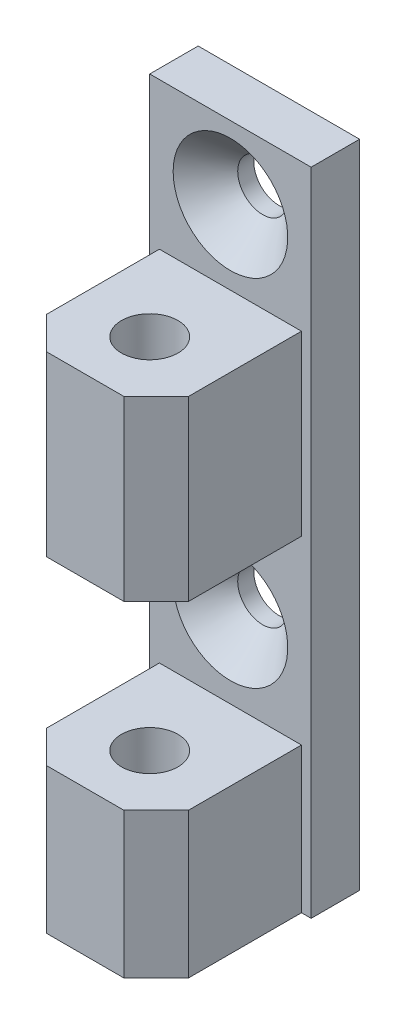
ISO-10303-21;
HEADER;
FILE_DESCRIPTION(('STEP AP214'),'2;1');
FILE_NAME('part.step','',(''),(''),'','','');
FILE_SCHEMA(('AUTOMOTIVE_DESIGN { 1 0 10303 214 1 1 1 1 }'));
ENDSEC;
DATA;
#1=APPLICATION_CONTEXT('core data for automotive mechanical design processes');
#2=APPLICATION_PROTOCOL_DEFINITION('international standard','automotive_design',2000,#1);
#3=PRODUCT_CONTEXT('',#1,'mechanical');
#4=PRODUCT('Part','Part','',(#3));
#5=PRODUCT_RELATED_PRODUCT_CATEGORY('part','',(#4));
#6=PRODUCT_DEFINITION_FORMATION('','',#4);
#7=PRODUCT_DEFINITION_CONTEXT('part definition',#1,'design');
#8=PRODUCT_DEFINITION('design','',#6,#7);
#9=PRODUCT_DEFINITION_SHAPE('','',#8);
#10=(LENGTH_UNIT() NAMED_UNIT(*) SI_UNIT(.MILLI.,.METRE.));
#11=(NAMED_UNIT(*) PLANE_ANGLE_UNIT() SI_UNIT($,.RADIAN.));
#12=(NAMED_UNIT(*) SI_UNIT($,.STERADIAN.) SOLID_ANGLE_UNIT());
#13=UNCERTAINTY_MEASURE_WITH_UNIT(LENGTH_MEASURE(1.E-05),#10,'distance_accuracy_value','');
#14=(GEOMETRIC_REPRESENTATION_CONTEXT(3) GLOBAL_UNCERTAINTY_ASSIGNED_CONTEXT((#13)) GLOBAL_UNIT_ASSIGNED_CONTEXT((#10,
#11,#12)) REPRESENTATION_CONTEXT('',''));
#15=CARTESIAN_POINT('',(0.,0.,0.));
#16=DIRECTION('',(0.,0.,1.));
#17=DIRECTION('',(1.,0.,0.));
#18=AXIS2_PLACEMENT_3D('',#15,#16,#17);
#19=CARTESIAN_POINT('',(0.,40.3,0.));
#20=DIRECTION('',(0.,0.,-1.));
#21=DIRECTION('',(-1.,0.,0.));
#22=AXIS2_PLACEMENT_3D('',#19,#20,#21);
#23=PLANE('',#22);
#24=DIRECTION('',(0.,-1.,0.));
#25=VECTOR('',#24,1.);
#26=CARTESIAN_POINT('',(2.6,40.6,0.));
#27=LINE('',#26,#25);
#28=CARTESIAN_POINT('',(2.59999999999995,31.2,0.));
#29=VERTEX_POINT('',#28);
#30=CARTESIAN_POINT('',(2.59999999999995,20.2,0.));
#31=VERTEX_POINT('',#30);
#32=EDGE_CURVE('E151',#29,#31,#27,.T.);
#33=ORIENTED_EDGE('',*,*,#32,.T.);
#34=DIRECTION('',(-1.,0.,0.));
#35=VECTOR('',#34,1.);
#36=CARTESIAN_POINT('',(0.,20.2,0.));
#37=LINE('',#36,#35);
#38=CARTESIAN_POINT('',(7.40000000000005,20.2,0.));
#39=VERTEX_POINT('',#38);
#40=EDGE_CURVE('E144',#39,#31,#37,.T.);
#41=ORIENTED_EDGE('',*,*,#40,.F.);
#42=DIRECTION('',(0.,-1.,0.));
#43=VECTOR('',#42,1.);
#44=CARTESIAN_POINT('',(7.4,40.6,0.));
#45=LINE('',#44,#43);
#46=CARTESIAN_POINT('',(7.4,31.2,0.));
#47=VERTEX_POINT('',#46);
#48=EDGE_CURVE('E293',#47,#39,#45,.T.);
#49=ORIENTED_EDGE('',*,*,#48,.F.);
#50=DIRECTION('',(1.,0.,0.));
#51=VECTOR('',#50,1.);
#52=CARTESIAN_POINT('',(0.,31.2,0.));
#53=LINE('',#52,#51);
#54=EDGE_CURVE('E40',#29,#47,#53,.T.);
#55=ORIENTED_EDGE('',*,*,#54,.F.);
#56=EDGE_LOOP('',(#33,#41,#49,#55));
#57=FACE_BOUND('',#56,.T.);
#58=ADVANCED_FACE('F17',(#57),#23,.F.);
#59=CARTESIAN_POINT('',(0.6,40.6,-2.));
#60=DIRECTION('',(0.707106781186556,0.,-0.707106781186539));
#61=DIRECTION('',(-0.707106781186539,0.,-0.707106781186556));
#62=AXIS2_PLACEMENT_3D('',#59,#60,#61);
#63=PLANE('',#62);
#64=DIRECTION('',(0.,-1.,0.));
#65=VECTOR('',#64,1.);
#66=CARTESIAN_POINT('',(0.6,40.6,-2.));
#67=LINE('',#66,#65);
#68=CARTESIAN_POINT('',(0.6,31.2,-2.));
#69=VERTEX_POINT('',#68);
#70=CARTESIAN_POINT('',(0.6,20.2,-2.));
#71=VERTEX_POINT('',#70);
#72=EDGE_CURVE('E152',#69,#71,#67,.T.);
#73=ORIENTED_EDGE('',*,*,#72,.T.);
#74=DIRECTION('',(0.707106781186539,0.,0.707106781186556));
#75=VECTOR('',#74,1.);
#76=CARTESIAN_POINT('',(0.6,20.2,-2.));
#77=LINE('',#76,#75);
#78=EDGE_CURVE('E254',#71,#31,#77,.T.);
#79=ORIENTED_EDGE('',*,*,#78,.T.);
#80=ORIENTED_EDGE('',*,*,#32,.F.);
#81=DIRECTION('',(-0.707106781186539,0.,-0.707106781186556));
#82=VECTOR('',#81,1.);
#83=CARTESIAN_POINT('',(0.6,31.2,-2.));
#84=LINE('',#83,#82);
#85=EDGE_CURVE('E267',#29,#69,#84,.T.);
#86=ORIENTED_EDGE('',*,*,#85,.T.);
#87=EDGE_LOOP('',(#73,#79,#80,#86));
#88=FACE_BOUND('',#87,.T.);
#89=ADVANCED_FACE('F350',(#88),#63,.F.);
#90=CARTESIAN_POINT('',(0.600000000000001,40.6,-9.));
#91=DIRECTION('',(1.,0.,0.));
#92=DIRECTION('',(0.,0.,-1.));
#93=AXIS2_PLACEMENT_3D('',#90,#91,#92);
#94=PLANE('',#93);
#95=DIRECTION('',(0.,-1.,0.));
#96=VECTOR('',#95,1.);
#97=CARTESIAN_POINT('',(0.600000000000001,40.6,-9.));
#98=LINE('',#97,#96);
#99=CARTESIAN_POINT('',(0.600000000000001,31.2,-9.));
#100=VERTEX_POINT('',#99);
#101=CARTESIAN_POINT('',(0.600000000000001,20.2,-9.));
#102=VERTEX_POINT('',#101);
#103=EDGE_CURVE('E162',#100,#102,#98,.T.);
#104=ORIENTED_EDGE('',*,*,#103,.T.);
#105=DIRECTION('',(0.,0.,1.));
#106=VECTOR('',#105,1.);
#107=CARTESIAN_POINT('',(0.600000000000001,20.2,-9.));
#108=LINE('',#107,#106);
#109=EDGE_CURVE('E251',#102,#71,#108,.T.);
#110=ORIENTED_EDGE('',*,*,#109,.T.);
#111=ORIENTED_EDGE('',*,*,#72,.F.);
#112=DIRECTION('',(0.,0.,-1.));
#113=VECTOR('',#112,1.);
#114=CARTESIAN_POINT('',(0.600000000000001,31.2,-9.));
#115=LINE('',#114,#113);
#116=EDGE_CURVE('E264',#69,#100,#115,.T.);
#117=ORIENTED_EDGE('',*,*,#116,.T.);
#118=EDGE_LOOP('',(#104,#110,#111,#117));
#119=FACE_BOUND('',#118,.T.);
#120=ADVANCED_FACE('F356',(#119),#94,.F.);
#121=CARTESIAN_POINT('',(9.4,40.6,-9.));
#122=DIRECTION('',(-1.,0.,0.));
#123=DIRECTION('',(0.,0.,1.));
#124=AXIS2_PLACEMENT_3D('',#121,#122,#123);
#125=PLANE('',#124);
#126=DIRECTION('',(0.,-1.,0.));
#127=VECTOR('',#126,1.);
#128=CARTESIAN_POINT('',(9.4,40.6,-2.));
#129=LINE('',#128,#127);
#130=CARTESIAN_POINT('',(9.4,31.2,-2.));
#131=VERTEX_POINT('',#130);
#132=CARTESIAN_POINT('',(9.4,20.2,-2.));
#133=VERTEX_POINT('',#132);
#134=EDGE_CURVE('E289',#131,#133,#129,.T.);
#135=ORIENTED_EDGE('',*,*,#134,.T.);
#136=DIRECTION('',(0.,0.,-1.));
#137=VECTOR('',#136,1.);
#138=CARTESIAN_POINT('',(9.4,20.2,-9.));
#139=LINE('',#138,#137);
#140=CARTESIAN_POINT('',(9.4,20.2,-9.));
#141=VERTEX_POINT('',#140);
#142=EDGE_CURVE('E248',#133,#141,#139,.T.);
#143=ORIENTED_EDGE('',*,*,#142,.T.);
#144=DIRECTION('',(0.,-1.,0.));
#145=VECTOR('',#144,1.);
#146=CARTESIAN_POINT('',(9.4,40.6,-9.));
#147=LINE('',#146,#145);
#148=CARTESIAN_POINT('',(9.4,31.2,-9.));
#149=VERTEX_POINT('',#148);
#150=EDGE_CURVE('E285',#149,#141,#147,.T.);
#151=ORIENTED_EDGE('',*,*,#150,.F.);
#152=DIRECTION('',(0.,0.,1.));
#153=VECTOR('',#152,1.);
#154=CARTESIAN_POINT('',(9.4,31.2,-9.));
#155=LINE('',#154,#153);
#156=EDGE_CURVE('E261',#149,#131,#155,.T.);
#157=ORIENTED_EDGE('',*,*,#156,.T.);
#158=EDGE_LOOP('',(#135,#143,#151,#157));
#159=FACE_BOUND('',#158,.T.);
#160=ADVANCED_FACE('F399',(#159),#125,.F.);
#161=CARTESIAN_POINT('',(9.4,40.6,-2.));
#162=DIRECTION('',(-0.707106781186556,0.,-0.707106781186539));
#163=DIRECTION('',(-0.707106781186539,0.,0.707106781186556));
#164=AXIS2_PLACEMENT_3D('',#161,#162,#163);
#165=PLANE('',#164);
#166=ORIENTED_EDGE('',*,*,#48,.T.);
#167=DIRECTION('',(0.707106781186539,0.,-0.707106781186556));
#168=VECTOR('',#167,1.);
#169=CARTESIAN_POINT('',(9.4,20.2,-2.));
#170=LINE('',#169,#168);
#171=EDGE_CURVE('E204',#39,#133,#170,.T.);
#172=ORIENTED_EDGE('',*,*,#171,.T.);
#173=ORIENTED_EDGE('',*,*,#134,.F.);
#174=DIRECTION('',(-0.707106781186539,0.,0.707106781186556));
#175=VECTOR('',#174,1.);
#176=CARTESIAN_POINT('',(9.4,31.2,-2.));
#177=LINE('',#176,#175);
#178=EDGE_CURVE('E195',#131,#47,#177,.T.);
#179=ORIENTED_EDGE('',*,*,#178,.T.);
#180=EDGE_LOOP('',(#166,#172,#173,#179));
#181=FACE_BOUND('',#180,.T.);
#182=ADVANCED_FACE('F343',(#181),#165,.F.);
#183=CARTESIAN_POINT('',(5.,40.6,-4.));
#184=DIRECTION('',(0.,-1.,0.));
#185=DIRECTION('',(0.,0.,-1.));
#186=AXIS2_PLACEMENT_3D('',#183,#184,#185);
#187=CYLINDRICAL_SURFACE('',#186,1.75);
#188=CARTESIAN_POINT('',(5.,20.2,-4.));
#189=DIRECTION('',(0.,1.,0.));
#190=DIRECTION('',(0.,0.,1.));
#191=AXIS2_PLACEMENT_3D('',#188,#189,#190);
#192=CIRCLE('',#191,1.75);
#193=CARTESIAN_POINT('',(5.,20.2,-2.25));
#194=VERTEX_POINT('',#193);
#195=EDGE_CURVE('E135',#194,#194,#192,.F.);
#196=ORIENTED_EDGE('',*,*,#195,.T.);
#197=EDGE_LOOP('',(#196));
#198=FACE_BOUND('',#197,.T.);
#199=CARTESIAN_POINT('',(5.,31.2,-4.));
#200=DIRECTION('',(0.,-1.,0.));
#201=DIRECTION('',(0.,0.,-1.));
#202=AXIS2_PLACEMENT_3D('',#199,#200,#201);
#203=CIRCLE('',#202,1.75);
#204=CARTESIAN_POINT('',(5.,31.2,-5.75));
#205=VERTEX_POINT('',#204);
#206=EDGE_CURVE('E192',#205,#205,#203,.F.);
#207=ORIENTED_EDGE('',*,*,#206,.T.);
#208=EDGE_LOOP('',(#207));
#209=FACE_BOUND('',#208,.T.);
#210=ADVANCED_FACE('F335',(#198,#209),#187,.F.);
#211=CARTESIAN_POINT('',(0.,40.3,-12.));
#212=DIRECTION('',(0.,-1.,0.));
#213=DIRECTION('',(0.,0.,-1.));
#214=AXIS2_PLACEMENT_3D('',#211,#212,#213);
#215=PLANE('',#214);
#216=DIRECTION('',(1.,0.,0.));
#217=VECTOR('',#216,1.);
#218=CARTESIAN_POINT('',(0.,40.3,-9.));
#219=LINE('',#218,#217);
#220=CARTESIAN_POINT('',(0.,40.3,-9.));
#221=VERTEX_POINT('',#220);
#222=CARTESIAN_POINT('',(10.,40.3,-9.));
#223=VERTEX_POINT('',#222);
#224=EDGE_CURVE('E155',#221,#223,#219,.T.);
#225=ORIENTED_EDGE('',*,*,#224,.T.);
#226=DIRECTION('',(0.,0.,-1.));
#227=VECTOR('',#226,1.);
#228=CARTESIAN_POINT('',(10.,40.3,0.));
#229=LINE('',#228,#227);
#230=CARTESIAN_POINT('',(10.,40.3,-12.));
#231=VERTEX_POINT('',#230);
#232=EDGE_CURVE('E181',#223,#231,#229,.T.);
#233=ORIENTED_EDGE('',*,*,#232,.T.);
#234=DIRECTION('',(-1.,0.,0.));
#235=VECTOR('',#234,1.);
#236=CARTESIAN_POINT('',(0.,40.3,-12.));
#237=LINE('',#236,#235);
#238=CARTESIAN_POINT('',(0.,40.3,-12.));
#239=VERTEX_POINT('',#238);
#240=EDGE_CURVE('E183',#231,#239,#237,.T.);
#241=ORIENTED_EDGE('',*,*,#240,.T.);
#242=DIRECTION('',(0.,0.,1.));
#243=VECTOR('',#242,1.);
#244=CARTESIAN_POINT('',(0.,40.3,0.));
#245=LINE('',#244,#243);
#246=EDGE_CURVE('E178',#239,#221,#245,.T.);
#247=ORIENTED_EDGE('',*,*,#246,.T.);
#248=EDGE_LOOP('',(#225,#233,#241,#247));
#249=FACE_BOUND('',#248,.T.);
#250=ADVANCED_FACE('F333',(#249),#215,.F.);
#251=CARTESIAN_POINT('',(0.,40.3,0.));
#252=DIRECTION('',(1.,0.,0.));
#253=DIRECTION('',(0.,0.,-1.));
#254=AXIS2_PLACEMENT_3D('',#251,#252,#253);
#255=PLANE('',#254);
#256=DIRECTION('',(0.,0.,1.));
#257=VECTOR('',#256,1.);
#258=CARTESIAN_POINT('',(0.,0.,0.));
#259=LINE('',#258,#257);
#260=CARTESIAN_POINT('',(0.,0.,-12.));
#261=VERTEX_POINT('',#260);
#262=CARTESIAN_POINT('',(0.,0.,-9.));
#263=VERTEX_POINT('',#262);
#264=EDGE_CURVE('E169',#261,#263,#259,.T.);
#265=ORIENTED_EDGE('',*,*,#264,.T.);
#266=DIRECTION('',(0.,-1.,0.));
#267=VECTOR('',#266,1.);
#268=CARTESIAN_POINT('',(0.,40.6,-9.));
#269=LINE('',#268,#267);
#270=EDGE_CURVE('E166',#221,#263,#269,.T.);
#271=ORIENTED_EDGE('',*,*,#270,.F.);
#272=ORIENTED_EDGE('',*,*,#246,.F.);
#273=DIRECTION('',(0.,-1.,0.));
#274=VECTOR('',#273,1.);
#275=CARTESIAN_POINT('',(0.,40.3,-12.));
#276=LINE('',#275,#274);
#277=EDGE_CURVE('E185',#239,#261,#276,.T.);
#278=ORIENTED_EDGE('',*,*,#277,.T.);
#279=EDGE_LOOP('',(#265,#271,#272,#278));
#280=FACE_BOUND('',#279,.T.);
#281=ADVANCED_FACE('F19',(#280),#255,.F.);
#282=CARTESIAN_POINT('',(7.4,9.,0.));
#283=VERTEX_POINT('',#282);
#284=CARTESIAN_POINT('',(7.4,0.,0.));
#285=VERTEX_POINT('',#284);
#286=EDGE_CURVE('E143',#283,#285,#45,.T.);
#287=ORIENTED_EDGE('',*,*,#286,.F.);
#288=DIRECTION('',(1.,0.,0.));
#289=VECTOR('',#288,1.);
#290=CARTESIAN_POINT('',(0.,9.,0.));
#291=LINE('',#290,#289);
#292=CARTESIAN_POINT('',(2.59999999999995,9.,0.));
#293=VERTEX_POINT('',#292);
#294=EDGE_CURVE('E32',#293,#283,#291,.T.);
#295=ORIENTED_EDGE('',*,*,#294,.F.);
#296=CARTESIAN_POINT('',(2.6,0.,0.));
#297=VERTEX_POINT('',#296);
#298=EDGE_CURVE('E141',#293,#297,#27,.T.);
#299=ORIENTED_EDGE('',*,*,#298,.T.);
#300=DIRECTION('',(1.,0.,0.));
#301=VECTOR('',#300,1.);
#302=CARTESIAN_POINT('',(0.,0.,0.));
#303=LINE('',#302,#301);
#304=EDGE_CURVE('E172',#297,#285,#303,.T.);
#305=ORIENTED_EDGE('',*,*,#304,.T.);
#306=EDGE_LOOP('',(#287,#295,#299,#305));
#307=FACE_BOUND('',#306,.T.);
#308=ADVANCED_FACE('F139',(#307),#23,.F.);
#309=CARTESIAN_POINT('',(10.,40.3,0.));
#310=DIRECTION('',(-1.,0.,0.));
#311=DIRECTION('',(0.,0.,1.));
#312=AXIS2_PLACEMENT_3D('',#309,#310,#311);
#313=PLANE('',#312);
#314=ORIENTED_EDGE('',*,*,#232,.F.);
#315=DIRECTION('',(0.,-1.,0.));
#316=VECTOR('',#315,1.);
#317=CARTESIAN_POINT('',(10.,40.6,-9.));
#318=LINE('',#317,#316);
#319=CARTESIAN_POINT('',(10.,0.,-9.));
#320=VERTEX_POINT('',#319);
#321=EDGE_CURVE('E282',#223,#320,#318,.T.);
#322=ORIENTED_EDGE('',*,*,#321,.T.);
#323=DIRECTION('',(0.,0.,-1.));
#324=VECTOR('',#323,1.);
#325=CARTESIAN_POINT('',(10.,0.,0.));
#326=LINE('',#325,#324);
#327=CARTESIAN_POINT('',(10.,0.,-12.));
#328=VERTEX_POINT('',#327);
#329=EDGE_CURVE('E174',#320,#328,#326,.T.);
#330=ORIENTED_EDGE('',*,*,#329,.T.);
#331=DIRECTION('',(0.,-1.,0.));
#332=VECTOR('',#331,1.);
#333=CARTESIAN_POINT('',(10.,40.3,-12.));
#334=LINE('',#333,#332);
#335=EDGE_CURVE('E188',#231,#328,#334,.T.);
#336=ORIENTED_EDGE('',*,*,#335,.F.);
#337=EDGE_LOOP('',(#314,#322,#330,#336));
#338=FACE_BOUND('',#337,.T.);
#339=ADVANCED_FACE('F331',(#338),#313,.F.);
#340=CARTESIAN_POINT('',(0.,40.3,-12.));
#341=DIRECTION('',(0.,0.,1.));
#342=DIRECTION('',(1.,0.,0.));
#343=AXIS2_PLACEMENT_3D('',#340,#341,#342);
#344=PLANE('',#343);
#345=CARTESIAN_POINT('',(5.,13.8,-12.));
#346=DIRECTION('',(0.,0.,1.));
#347=DIRECTION('',(1.,0.,0.));
#348=AXIS2_PLACEMENT_3D('',#345,#346,#347);
#349=CIRCLE('',#348,1.55);
#350=CARTESIAN_POINT('',(6.55,13.8,-12.));
#351=VERTEX_POINT('',#350);
#352=EDGE_CURVE('E229',#351,#351,#349,.T.);
#353=ORIENTED_EDGE('',*,*,#352,.T.);
#354=EDGE_LOOP('',(#353));
#355=FACE_BOUND('',#354,.T.);
#356=CARTESIAN_POINT('',(5.,35.8,-12.));
#357=DIRECTION('',(0.,0.,1.));
#358=DIRECTION('',(1.,0.,0.));
#359=AXIS2_PLACEMENT_3D('',#356,#357,#358);
#360=CIRCLE('',#359,1.55);
#361=CARTESIAN_POINT('',(6.55,35.8,-12.));
#362=VERTEX_POINT('',#361);
#363=EDGE_CURVE('E145',#362,#362,#360,.T.);
#364=ORIENTED_EDGE('',*,*,#363,.T.);
#365=EDGE_LOOP('',(#364));
#366=FACE_BOUND('',#365,.T.);
#367=DIRECTION('',(-1.,0.,0.));
#368=VECTOR('',#367,1.);
#369=CARTESIAN_POINT('',(0.,0.,-12.));
#370=LINE('',#369,#368);
#371=EDGE_CURVE('E176',#328,#261,#370,.T.);
#372=ORIENTED_EDGE('',*,*,#371,.T.);
#373=ORIENTED_EDGE('',*,*,#277,.F.);
#374=ORIENTED_EDGE('',*,*,#240,.F.);
#375=ORIENTED_EDGE('',*,*,#335,.T.);
#376=EDGE_LOOP('',(#372,#373,#374,#375));
#377=FACE_BOUND('',#376,.T.);
#378=ADVANCED_FACE('F327',(#355,#366,#377),#344,.F.);
#379=CARTESIAN_POINT('',(0.,0.,-12.));
#380=DIRECTION('',(0.,-1.,0.));
#381=DIRECTION('',(0.,0.,-1.));
#382=AXIS2_PLACEMENT_3D('',#379,#380,#381);
#383=PLANE('',#382);
#384=CARTESIAN_POINT('',(5.,0.,-4.));
#385=DIRECTION('',(0.,-1.,0.));
#386=DIRECTION('',(0.,0.,-1.));
#387=AXIS2_PLACEMENT_3D('',#384,#385,#386);
#388=CIRCLE('',#387,1.75);
#389=CARTESIAN_POINT('',(5.,0.,-5.75));
#390=VERTEX_POINT('',#389);
#391=EDGE_CURVE('E270',#390,#390,#388,.T.);
#392=ORIENTED_EDGE('',*,*,#391,.F.);
#393=EDGE_LOOP('',(#392));
#394=FACE_BOUND('',#393,.T.);
#395=DIRECTION('',(1.,0.,0.));
#396=VECTOR('',#395,1.);
#397=CARTESIAN_POINT('',(10.,0.,-9.));
#398=LINE('',#397,#396);
#399=CARTESIAN_POINT('',(9.4,0.,-9.));
#400=VERTEX_POINT('',#399);
#401=EDGE_CURVE('E279',#400,#320,#398,.T.);
#402=ORIENTED_EDGE('',*,*,#401,.F.);
#403=DIRECTION('',(0.,0.,-1.));
#404=VECTOR('',#403,1.);
#405=CARTESIAN_POINT('',(9.4,0.,-9.));
#406=LINE('',#405,#404);
#407=CARTESIAN_POINT('',(9.4,0.,-2.));
#408=VERTEX_POINT('',#407);
#409=EDGE_CURVE('E276',#408,#400,#406,.T.);
#410=ORIENTED_EDGE('',*,*,#409,.F.);
#411=DIRECTION('',(0.707106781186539,0.,-0.707106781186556));
#412=VECTOR('',#411,1.);
#413=CARTESIAN_POINT('',(9.4,0.,-2.));
#414=LINE('',#413,#412);
#415=EDGE_CURVE('E273',#285,#408,#414,.T.);
#416=ORIENTED_EDGE('',*,*,#415,.F.);
#417=ORIENTED_EDGE('',*,*,#304,.F.);
#418=DIRECTION('',(0.707106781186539,0.,0.707106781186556));
#419=VECTOR('',#418,1.);
#420=CARTESIAN_POINT('',(0.6,0.,-2.));
#421=LINE('',#420,#419);
#422=CARTESIAN_POINT('',(0.6,0.,-2.));
#423=VERTEX_POINT('',#422);
#424=EDGE_CURVE('E149',#423,#297,#421,.T.);
#425=ORIENTED_EDGE('',*,*,#424,.F.);
#426=DIRECTION('',(0.,0.,1.));
#427=VECTOR('',#426,1.);
#428=CARTESIAN_POINT('',(0.600000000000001,0.,-9.));
#429=LINE('',#428,#427);
#430=CARTESIAN_POINT('',(0.600000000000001,0.,-9.));
#431=VERTEX_POINT('',#430);
#432=EDGE_CURVE('E297',#431,#423,#429,.T.);
#433=ORIENTED_EDGE('',*,*,#432,.F.);
#434=DIRECTION('',(1.,0.,0.));
#435=VECTOR('',#434,1.);
#436=CARTESIAN_POINT('',(0.,0.,-9.));
#437=LINE('',#436,#435);
#438=EDGE_CURVE('E284',#263,#431,#437,.T.);
#439=ORIENTED_EDGE('',*,*,#438,.F.);
#440=ORIENTED_EDGE('',*,*,#264,.F.);
#441=ORIENTED_EDGE('',*,*,#371,.F.);
#442=ORIENTED_EDGE('',*,*,#329,.F.);
#443=EDGE_LOOP('',(#402,#410,#416,#417,#425,#433,#439,#440,#441,#442));
#444=FACE_BOUND('',#443,.T.);
#445=ADVANCED_FACE('F306',(#394,#444),#383,.T.);
#446=ORIENTED_EDGE('',*,*,#298,.F.);
#447=DIRECTION('',(-0.707106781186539,0.,-0.707106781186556));
#448=VECTOR('',#447,1.);
#449=CARTESIAN_POINT('',(0.6,9.,-2.));
#450=LINE('',#449,#448);
#451=CARTESIAN_POINT('',(0.6,9.,-2.));
#452=VERTEX_POINT('',#451);
#453=EDGE_CURVE('E128',#293,#452,#450,.T.);
#454=ORIENTED_EDGE('',*,*,#453,.T.);
#455=EDGE_CURVE('E157',#452,#423,#67,.T.);
#456=ORIENTED_EDGE('',*,*,#455,.T.);
#457=ORIENTED_EDGE('',*,*,#424,.T.);
#458=EDGE_LOOP('',(#446,#454,#456,#457));
#459=FACE_BOUND('',#458,.T.);
#460=ADVANCED_FACE('F147',(#459),#63,.F.);
#461=ORIENTED_EDGE('',*,*,#455,.F.);
#462=DIRECTION('',(0.,0.,-1.));
#463=VECTOR('',#462,1.);
#464=CARTESIAN_POINT('',(0.600000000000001,9.,-9.));
#465=LINE('',#464,#463);
#466=CARTESIAN_POINT('',(0.600000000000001,9.,-9.));
#467=VERTEX_POINT('',#466);
#468=EDGE_CURVE('E131',#452,#467,#465,.T.);
#469=ORIENTED_EDGE('',*,*,#468,.T.);
#470=EDGE_CURVE('E165',#467,#431,#98,.T.);
#471=ORIENTED_EDGE('',*,*,#470,.T.);
#472=ORIENTED_EDGE('',*,*,#432,.T.);
#473=EDGE_LOOP('',(#461,#469,#471,#472));
#474=FACE_BOUND('',#473,.T.);
#475=ADVANCED_FACE('F301',(#474),#94,.F.);
#476=CARTESIAN_POINT('',(0.,40.6,-9.));
#477=DIRECTION('',(0.,0.,-1.));
#478=DIRECTION('',(-1.,0.,0.));
#479=AXIS2_PLACEMENT_3D('',#476,#477,#478);
#480=PLANE('',#479);
#481=CARTESIAN_POINT('',(5.,13.8,-9.));
#482=DIRECTION('',(0.,0.,-1.));
#483=DIRECTION('',(-1.,0.,0.));
#484=AXIS2_PLACEMENT_3D('',#481,#482,#483);
#485=CIRCLE('',#484,3.55000000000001);
#486=CARTESIAN_POINT('',(1.44999999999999,13.8,-9.));
#487=VERTEX_POINT('',#486);
#488=EDGE_CURVE('E25',#487,#487,#485,.T.);
#489=ORIENTED_EDGE('',*,*,#488,.T.);
#490=EDGE_LOOP('',(#489));
#491=FACE_BOUND('',#490,.T.);
#492=CARTESIAN_POINT('',(5.,35.8,-9.));
#493=DIRECTION('',(0.,0.,-1.));
#494=DIRECTION('',(-1.,0.,0.));
#495=AXIS2_PLACEMENT_3D('',#492,#493,#494);
#496=CIRCLE('',#495,3.55000000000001);
#497=CARTESIAN_POINT('',(1.44999999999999,35.8,-9.));
#498=VERTEX_POINT('',#497);
#499=EDGE_CURVE('E207',#498,#498,#496,.T.);
#500=ORIENTED_EDGE('',*,*,#499,.T.);
#501=EDGE_LOOP('',(#500));
#502=FACE_BOUND('',#501,.T.);
#503=ORIENTED_EDGE('',*,*,#470,.F.);
#504=DIRECTION('',(1.,0.,0.));
#505=VECTOR('',#504,1.);
#506=CARTESIAN_POINT('',(0.,9.,-9.));
#507=LINE('',#506,#505);
#508=CARTESIAN_POINT('',(9.4,9.,-9.));
#509=VERTEX_POINT('',#508);
#510=EDGE_CURVE('E236',#467,#509,#507,.T.);
#511=ORIENTED_EDGE('',*,*,#510,.T.);
#512=EDGE_CURVE('E288',#509,#400,#147,.T.);
#513=ORIENTED_EDGE('',*,*,#512,.T.);
#514=ORIENTED_EDGE('',*,*,#401,.T.);
#515=ORIENTED_EDGE('',*,*,#321,.F.);
#516=ORIENTED_EDGE('',*,*,#224,.F.);
#517=ORIENTED_EDGE('',*,*,#270,.T.);
#518=ORIENTED_EDGE('',*,*,#438,.T.);
#519=EDGE_LOOP('',(#503,#511,#513,#514,#515,#516,#517,#518));
#520=FACE_BOUND('',#519,.T.);
#521=DIRECTION('',(-1.,0.,0.));
#522=VECTOR('',#521,1.);
#523=CARTESIAN_POINT('',(0.,20.2,-9.));
#524=LINE('',#523,#522);
#525=EDGE_CURVE('E201',#141,#102,#524,.T.);
#526=ORIENTED_EDGE('',*,*,#525,.T.);
#527=ORIENTED_EDGE('',*,*,#103,.F.);
#528=DIRECTION('',(1.,0.,0.));
#529=VECTOR('',#528,1.);
#530=CARTESIAN_POINT('',(0.,31.2,-9.));
#531=LINE('',#530,#529);
#532=EDGE_CURVE('E196',#100,#149,#531,.T.);
#533=ORIENTED_EDGE('',*,*,#532,.T.);
#534=ORIENTED_EDGE('',*,*,#150,.T.);
#535=EDGE_LOOP('',(#526,#527,#533,#534));
#536=FACE_BOUND('',#535,.T.);
#537=ADVANCED_FACE('F212',(#491,#502,#520,#536),#480,.F.);
#538=ORIENTED_EDGE('',*,*,#512,.F.);
#539=DIRECTION('',(0.,0.,1.));
#540=VECTOR('',#539,1.);
#541=CARTESIAN_POINT('',(9.4,9.,-9.));
#542=LINE('',#541,#540);
#543=CARTESIAN_POINT('',(9.4,9.,-2.));
#544=VERTEX_POINT('',#543);
#545=EDGE_CURVE('E242',#509,#544,#542,.T.);
#546=ORIENTED_EDGE('',*,*,#545,.T.);
#547=EDGE_CURVE('E292',#544,#408,#129,.T.);
#548=ORIENTED_EDGE('',*,*,#547,.T.);
#549=ORIENTED_EDGE('',*,*,#409,.T.);
#550=EDGE_LOOP('',(#538,#546,#548,#549));
#551=FACE_BOUND('',#550,.T.);
#552=ADVANCED_FACE('F314',(#551),#125,.F.);
#553=ORIENTED_EDGE('',*,*,#547,.F.);
#554=DIRECTION('',(-0.707106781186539,0.,0.707106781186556));
#555=VECTOR('',#554,1.);
#556=CARTESIAN_POINT('',(9.4,9.,-2.));
#557=LINE('',#556,#555);
#558=EDGE_CURVE('E200',#544,#283,#557,.T.);
#559=ORIENTED_EDGE('',*,*,#558,.T.);
#560=ORIENTED_EDGE('',*,*,#286,.T.);
#561=ORIENTED_EDGE('',*,*,#415,.T.);
#562=EDGE_LOOP('',(#553,#559,#560,#561));
#563=FACE_BOUND('',#562,.T.);
#564=ADVANCED_FACE('F311',(#563),#165,.F.);
#565=CARTESIAN_POINT('',(5.,9.,-4.));
#566=DIRECTION('',(0.,-1.,0.));
#567=DIRECTION('',(0.,0.,-1.));
#568=AXIS2_PLACEMENT_3D('',#565,#566,#567);
#569=CIRCLE('',#568,1.75);
#570=CARTESIAN_POINT('',(5.,9.,-5.75));
#571=VERTEX_POINT('',#570);
#572=EDGE_CURVE('E197',#571,#571,#569,.F.);
#573=ORIENTED_EDGE('',*,*,#572,.T.);
#574=EDGE_LOOP('',(#573));
#575=FACE_BOUND('',#574,.T.);
#576=ORIENTED_EDGE('',*,*,#391,.T.);
#577=EDGE_LOOP('',(#576));
#578=FACE_BOUND('',#577,.T.);
#579=ADVANCED_FACE('F346',(#575,#578),#187,.F.);
#580=CARTESIAN_POINT('',(0.,31.2,-9.));
#581=DIRECTION('',(0.,-1.,0.));
#582=DIRECTION('',(0.,0.,-1.));
#583=AXIS2_PLACEMENT_3D('',#580,#581,#582);
#584=PLANE('',#583);
#585=ORIENTED_EDGE('',*,*,#206,.F.);
#586=EDGE_LOOP('',(#585));
#587=FACE_BOUND('',#586,.T.);
#588=ORIENTED_EDGE('',*,*,#54,.T.);
#589=ORIENTED_EDGE('',*,*,#178,.F.);
#590=ORIENTED_EDGE('',*,*,#156,.F.);
#591=ORIENTED_EDGE('',*,*,#532,.F.);
#592=ORIENTED_EDGE('',*,*,#116,.F.);
#593=ORIENTED_EDGE('',*,*,#85,.F.);
#594=EDGE_LOOP('',(#588,#589,#590,#591,#592,#593));
#595=FACE_BOUND('',#594,.T.);
#596=ADVANCED_FACE('F389',(#587,#595),#584,.F.);
#597=CARTESIAN_POINT('',(0.,20.2,-9.));
#598=DIRECTION('',(0.,1.,0.));
#599=DIRECTION('',(0.,0.,1.));
#600=AXIS2_PLACEMENT_3D('',#597,#598,#599);
#601=PLANE('',#600);
#602=ORIENTED_EDGE('',*,*,#195,.F.);
#603=EDGE_LOOP('',(#602));
#604=FACE_BOUND('',#603,.T.);
#605=ORIENTED_EDGE('',*,*,#109,.F.);
#606=ORIENTED_EDGE('',*,*,#525,.F.);
#607=ORIENTED_EDGE('',*,*,#142,.F.);
#608=ORIENTED_EDGE('',*,*,#171,.F.);
#609=ORIENTED_EDGE('',*,*,#40,.T.);
#610=ORIENTED_EDGE('',*,*,#78,.F.);
#611=EDGE_LOOP('',(#605,#606,#607,#608,#609,#610));
#612=FACE_BOUND('',#611,.T.);
#613=ADVANCED_FACE('F384',(#604,#612),#601,.F.);
#614=CARTESIAN_POINT('',(0.,9.,-9.));
#615=DIRECTION('',(0.,-1.,0.));
#616=DIRECTION('',(0.,0.,-1.));
#617=AXIS2_PLACEMENT_3D('',#614,#615,#616);
#618=PLANE('',#617);
#619=ORIENTED_EDGE('',*,*,#572,.F.);
#620=EDGE_LOOP('',(#619));
#621=FACE_BOUND('',#620,.T.);
#622=ORIENTED_EDGE('',*,*,#294,.T.);
#623=ORIENTED_EDGE('',*,*,#558,.F.);
#624=ORIENTED_EDGE('',*,*,#545,.F.);
#625=ORIENTED_EDGE('',*,*,#510,.F.);
#626=ORIENTED_EDGE('',*,*,#468,.F.);
#627=ORIENTED_EDGE('',*,*,#453,.F.);
#628=EDGE_LOOP('',(#622,#623,#624,#625,#626,#627));
#629=FACE_BOUND('',#628,.T.);
#630=ADVANCED_FACE('F129',(#621,#629),#618,.F.);
#631=CARTESIAN_POINT('',(5.,35.8,-12.));
#632=DIRECTION('',(0.,0.,1.));
#633=DIRECTION('',(1.,0.,0.));
#634=AXIS2_PLACEMENT_3D('',#631,#632,#633);
#635=CYLINDRICAL_SURFACE('',#634,1.55);
#636=CARTESIAN_POINT('',(5.,35.8,-11.));
#637=DIRECTION('',(0.,0.,-1.));
#638=DIRECTION('',(-1.,0.,0.));
#639=AXIS2_PLACEMENT_3D('',#636,#637,#638);
#640=CIRCLE('',#639,1.55);
#641=CARTESIAN_POINT('',(3.45,35.8,-11.));
#642=VERTEX_POINT('',#641);
#643=EDGE_CURVE('E11',#642,#642,#640,.F.);
#644=ORIENTED_EDGE('',*,*,#643,.T.);
#645=EDGE_LOOP('',(#644));
#646=FACE_BOUND('',#645,.T.);
#647=ORIENTED_EDGE('',*,*,#363,.F.);
#648=EDGE_LOOP('',(#647));
#649=FACE_BOUND('',#648,.T.);
#650=ADVANCED_FACE('F225',(#646,#649),#635,.F.);
#651=CARTESIAN_POINT('',(5.,13.8,-12.));
#652=DIRECTION('',(0.,0.,1.));
#653=DIRECTION('',(1.,0.,0.));
#654=AXIS2_PLACEMENT_3D('',#651,#652,#653);
#655=CYLINDRICAL_SURFACE('',#654,1.55);
#656=CARTESIAN_POINT('',(5.,13.8,-11.));
#657=DIRECTION('',(0.,0.,-1.));
#658=DIRECTION('',(-1.,0.,0.));
#659=AXIS2_PLACEMENT_3D('',#656,#657,#658);
#660=CIRCLE('',#659,1.55);
#661=CARTESIAN_POINT('',(3.45,13.8,-11.));
#662=VERTEX_POINT('',#661);
#663=EDGE_CURVE('E191',#662,#662,#660,.F.);
#664=ORIENTED_EDGE('',*,*,#663,.T.);
#665=EDGE_LOOP('',(#664));
#666=FACE_BOUND('',#665,.T.);
#667=ORIENTED_EDGE('',*,*,#352,.F.);
#668=EDGE_LOOP('',(#667));
#669=FACE_BOUND('',#668,.T.);
#670=ADVANCED_FACE('F219',(#666,#669),#655,.F.);
#671=CARTESIAN_POINT('',(5.,13.8,-11.));
#672=DIRECTION('',(0.,0.,1.));
#673=DIRECTION('',(1.,0.,0.));
#674=AXIS2_PLACEMENT_3D('',#671,#672,#673);
#675=CONICAL_SURFACE('',#674,1.55,0.78539816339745);
#676=ORIENTED_EDGE('',*,*,#488,.F.);
#677=EDGE_LOOP('',(#676));
#678=FACE_BOUND('',#677,.T.);
#679=ORIENTED_EDGE('',*,*,#663,.F.);
#680=EDGE_LOOP('',(#679));
#681=FACE_BOUND('',#680,.T.);
#682=ADVANCED_FACE('F215',(#678,#681),#675,.F.);
#683=CARTESIAN_POINT('',(5.,35.8,-11.));
#684=DIRECTION('',(0.,0.,1.));
#685=DIRECTION('',(1.,0.,0.));
#686=AXIS2_PLACEMENT_3D('',#683,#684,#685);
#687=CONICAL_SURFACE('',#686,1.55,0.78539816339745);
#688=ORIENTED_EDGE('',*,*,#499,.F.);
#689=EDGE_LOOP('',(#688));
#690=FACE_BOUND('',#689,.T.);
#691=ORIENTED_EDGE('',*,*,#643,.F.);
#692=EDGE_LOOP('',(#691));
#693=FACE_BOUND('',#692,.T.);
#694=ADVANCED_FACE('F218',(#690,#693),#687,.F.);
#695=CLOSED_SHELL('',(#58,#89,#120,#160,#182,#210,#250,#281,#308,#339,#378,#445,#460,#475,#537,
#552,#564,#579,#596,#613,#630,#650,#670,#682,#694));
#696=MANIFOLD_SOLID_BREP('B1',#695);
#697=ADVANCED_BREP_SHAPE_REPRESENTATION('',(#18,#696),#14);
#698=SHAPE_DEFINITION_REPRESENTATION(#9,#697);
ENDSEC;
END-ISO-10303-21;
